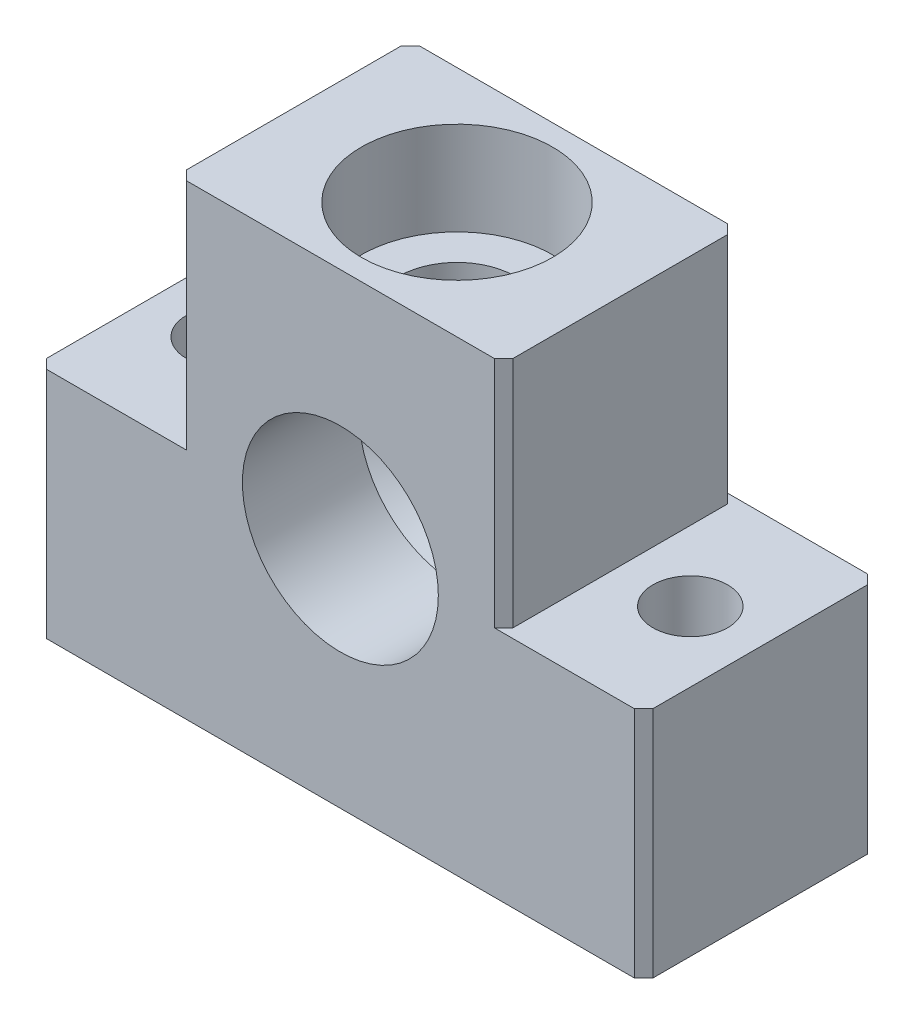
from build123d import *

# Parameters (mm, degrees)
SKETCH1_W                      = 13
SKETCH1_H                      = 5
BOSS_EXTRUDE1_DEPTH            = 10
F_2_5_2_5_DIAMETER_HOLE1_D     = 2.5
F_2_5_2_5_DIAMETER_HOLE1_DEPTH = 5
F_2_5_2_5_DIAMETER_HOLE1_TIP   = 1.25
F_4_1_4_1_DIAMETER_HOLE1_D     = 4.1
F_4_1_4_1_DIAMETER_HOLE1_DEPTH = 2
F_4_2_4_2_DIAMETER_HOLE1_D     = 4.2
F_4_2_4_2_DIAMETER_HOLE1_DEPTH = 2.5
F_4_2_4_2_DIAMETER_HOLE1_TIP   = 1.2618073
SKETCH18_W                     = 3
SKETCH18_H                     = 5
CUT_EXTRUDE1_DEPTH             = 5
M2_TAPPED_HOLE1_D              = 1.6
CHAMFER1_SIZE                  = 0.2


with BuildPart() as part:
    # Sketch1 → Boss-Extrude1 (new body)
    with BuildSketch(Plane(origin=(0, 0, 0), x_dir=(1, 0, 0), z_dir=(0, 1, 0))):
        Rectangle(SKETCH1_W, SKETCH1_H)
    extrude(amount=BOSS_EXTRUDE1_DEPTH)

    # 2.5 _2.5_ Diameter Hole1
    with Locations(Plane(origin=(0, 10, 0), x_dir=(1, 0, 0), z_dir=(0, 1, 0))):
        with Locations((0, 0)):
            Hole(F_2_5_2_5_DIAMETER_HOLE1_D / 2, depth=F_2_5_2_5_DIAMETER_HOLE1_DEPTH)
            with Locations((0, 0, -(F_2_5_2_5_DIAMETER_HOLE1_DEPTH + F_2_5_2_5_DIAMETER_HOLE1_TIP / 2))):  # 90° drill point
                Cone(0, F_2_5_2_5_DIAMETER_HOLE1_D / 2, F_2_5_2_5_DIAMETER_HOLE1_TIP, mode=Mode.SUBTRACT)

    # 4.1 _4.1_ Diameter Hole1
    with Locations(Plane(origin=(0, 10, 0), x_dir=(1, 0, 0), z_dir=(0, 1, 0))):
        with Locations((0, 0)):
            Hole(F_4_1_4_1_DIAMETER_HOLE1_D / 2, depth=F_4_1_4_1_DIAMETER_HOLE1_DEPTH)

    # 4.2 _4.2_ Diameter Hole1
    with Locations(Plane.XY.offset(2.5)):
        with Locations((0, 5)):
            Hole(F_4_2_4_2_DIAMETER_HOLE1_D / 2, depth=F_4_2_4_2_DIAMETER_HOLE1_DEPTH)
            with Locations((0, 0, -(F_4_2_4_2_DIAMETER_HOLE1_DEPTH + F_4_2_4_2_DIAMETER_HOLE1_TIP / 2))):  # 118° drill point
                Cone(0, F_4_2_4_2_DIAMETER_HOLE1_D / 2, F_4_2_4_2_DIAMETER_HOLE1_TIP, mode=Mode.SUBTRACT)

    # Sketch18 → Cut-Extrude1 (cut)
    with BuildSketch(Plane(origin=(0, 10, 0), x_dir=(1, 0, 0), z_dir=(0, 1, 0))):
        with Locations((-5, 0)):
            Rectangle(SKETCH18_W, SKETCH18_H)
        with Locations((5, 0)):
            Rectangle(SKETCH18_W, SKETCH18_H)
    extrude(amount=-CUT_EXTRUDE1_DEPTH, mode=Mode.SUBTRACT)

    # M2 Tapped Hole1 (through all)
    with Locations(Plane(origin=(0, 0, 0), x_dir=(-1, 0, 0), z_dir=(0, -1, 0))):
        with Locations((5, 0), (-5, 0)):
            Hole(M2_TAPPED_HOLE1_D / 2)

    # Chamfer1
    chamfer1_edges = [part.edges().sort_by_distance(p)[0] for p in [
        (-6.5, 2.5, -2.5),
        (-6.5, 2.5, 2.5),
        (-3.5, 7.5, -2.5),
        (-3.5, 7.5, 2.5),
        (6.5, 2.5, -2.5),
        (6.5, 2.5, 2.5),
        (3.5, 7.5, 2.5),
        (3.5, 7.5, -2.5),
    ]]
    chamfer(chamfer1_edges, length=CHAMFER1_SIZE)


solid = part.part
